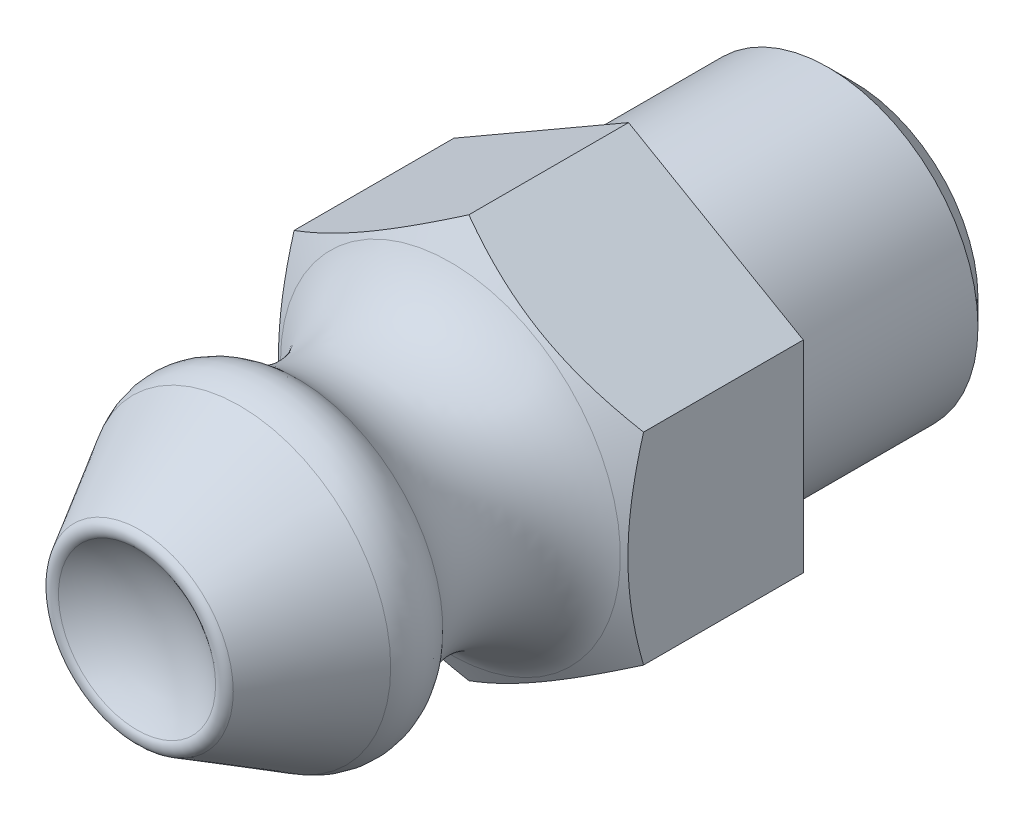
ISO-10303-21;
HEADER;
FILE_DESCRIPTION(('STEP AP214'),'2;1');
FILE_NAME('part.step','',(''),(''),'','','');
FILE_SCHEMA(('AUTOMOTIVE_DESIGN { 1 0 10303 214 1 1 1 1 }'));
ENDSEC;
DATA;
#1=APPLICATION_CONTEXT('core data for automotive mechanical design processes');
#2=APPLICATION_PROTOCOL_DEFINITION('international standard','automotive_design',2000,#1);
#3=PRODUCT_CONTEXT('',#1,'mechanical');
#4=PRODUCT('Part','Part','',(#3));
#5=PRODUCT_RELATED_PRODUCT_CATEGORY('part','',(#4));
#6=PRODUCT_DEFINITION_FORMATION('','',#4);
#7=PRODUCT_DEFINITION_CONTEXT('part definition',#1,'design');
#8=PRODUCT_DEFINITION('design','',#6,#7);
#9=PRODUCT_DEFINITION_SHAPE('','',#8);
#10=(LENGTH_UNIT() NAMED_UNIT(*) SI_UNIT(.MILLI.,.METRE.));
#11=(NAMED_UNIT(*) PLANE_ANGLE_UNIT() SI_UNIT($,.RADIAN.));
#12=(NAMED_UNIT(*) SI_UNIT($,.STERADIAN.) SOLID_ANGLE_UNIT());
#13=UNCERTAINTY_MEASURE_WITH_UNIT(LENGTH_MEASURE(1.E-05),#10,'distance_accuracy_value','');
#14=(GEOMETRIC_REPRESENTATION_CONTEXT(3) GLOBAL_UNCERTAINTY_ASSIGNED_CONTEXT((#13)) GLOBAL_UNIT_ASSIGNED_CONTEXT((#10,
#11,#12)) REPRESENTATION_CONTEXT('',''));
#15=CARTESIAN_POINT('',(0.,0.,0.));
#16=DIRECTION('',(0.,0.,1.));
#17=DIRECTION('',(1.,0.,0.));
#18=AXIS2_PLACEMENT_3D('',#15,#16,#17);
#19=CARTESIAN_POINT('',(3.49999999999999,2.02072594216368,10.));
#20=DIRECTION('',(-0.5,-0.866025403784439,0.));
#21=DIRECTION('',(0.866025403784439,-0.5,0.));
#22=AXIS2_PLACEMENT_3D('',#19,#20,#21);
#23=PLANE('',#22);
#24=DIRECTION('',(0.,0.,-1.));
#25=VECTOR('',#24,1.);
#26=CARTESIAN_POINT('',(0.,4.04145188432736,10.));
#27=LINE('',#26,#25);
#28=CARTESIAN_POINT('',(0.,4.04145188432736,3.2));
#29=VERTEX_POINT('',#28);
#30=CARTESIAN_POINT('',(0.,4.04145188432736,0.));
#31=VERTEX_POINT('',#30);
#32=EDGE_CURVE('E90',#29,#31,#27,.T.);
#33=ORIENTED_EDGE('',*,*,#32,.F.);
#34=CARTESIAN_POINT('',(-0.000200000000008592,4.04156735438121,3.19993333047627));
#35=CARTESIAN_POINT('',(0.153607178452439,3.95276673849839,3.25122160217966));
#36=CARTESIAN_POINT('',(0.308742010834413,3.86319960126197,3.29786643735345));
#37=CARTESIAN_POINT('',(0.621698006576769,3.68251437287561,3.37928551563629));
#38=CARTESIAN_POINT('',(0.779524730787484,3.59139307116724,3.41403095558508));
#39=CARTESIAN_POINT('',(1.09322221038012,3.41027974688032,3.46811736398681));
#40=CARTESIAN_POINT('',(1.24904469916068,3.32031559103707,3.48781830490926));
#41=CARTESIAN_POINT('',(1.56142288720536,3.1399639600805,3.51133725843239));
#42=CARTESIAN_POINT('',(1.71797745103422,3.04957714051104,3.51517474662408));
#43=CARTESIAN_POINT('',(2.01050921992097,2.88068384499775,3.50719208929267));
#44=CARTESIAN_POINT('',(2.14653021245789,2.80215208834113,3.49733195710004));
#45=CARTESIAN_POINT('',(2.41768602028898,2.64560020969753,3.46608092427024));
#46=CARTESIAN_POINT('',(2.55281989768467,2.56758062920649,3.44467934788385));
#47=CARTESIAN_POINT('',(2.82453479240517,2.41070596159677,3.39117698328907));
#48=CARTESIAN_POINT('',(2.96108141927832,2.33187072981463,3.35884939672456));
#49=CARTESIAN_POINT('',(3.23213809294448,2.17537608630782,3.28547845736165));
#50=CARTESIAN_POINT('',(3.36665161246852,2.09771466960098,3.24445234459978));
#51=CARTESIAN_POINT('',(3.50019999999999,2.02061047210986,3.19993333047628));
#52=B_SPLINE_CURVE_WITH_KNOTS('',3,(#34,#35,#36,#37,#38,#39,#40,#41,#42,#43,#44,#45,#46,#47,#48,
#49,#50,#51),.UNSPECIFIED.,.F.,.F.,(4,2,2,2,2,2,2,2,4),(0.,0.554793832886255,1.11092123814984,
1.65328467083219,2.19498204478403,2.6666513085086,3.13875761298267,3.62133612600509,
4.10296698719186),.UNSPECIFIED.);
#53=CARTESIAN_POINT('',(3.49999999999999,2.02072594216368,3.2));
#54=VERTEX_POINT('',#53);
#55=EDGE_CURVE('E83',#29,#54,#52,.T.);
#56=ORIENTED_EDGE('',*,*,#55,.T.);
#57=DIRECTION('',(0.,0.,-1.));
#58=VECTOR('',#57,1.);
#59=CARTESIAN_POINT('',(3.49999999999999,2.02072594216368,10.));
#60=LINE('',#59,#58);
#61=CARTESIAN_POINT('',(3.49999999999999,2.02072594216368,0.));
#62=VERTEX_POINT('',#61);
#63=EDGE_CURVE('E52',#54,#62,#60,.T.);
#64=ORIENTED_EDGE('',*,*,#63,.T.);
#65=DIRECTION('',(-0.866025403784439,0.5,0.));
#66=VECTOR('',#65,1.);
#67=CARTESIAN_POINT('',(3.49999999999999,2.02072594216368,0.));
#68=LINE('',#67,#66);
#69=EDGE_CURVE('E178',#62,#31,#68,.T.);
#70=ORIENTED_EDGE('',*,*,#69,.T.);
#71=EDGE_LOOP('',(#33,#56,#64,#70));
#72=FACE_BOUND('',#71,.T.);
#73=ADVANCED_FACE('F29',(#72),#23,.F.);
#74=CARTESIAN_POINT('',(0.,4.04145188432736,10.));
#75=DIRECTION('',(0.5,-0.866025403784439,0.));
#76=DIRECTION('',(0.866025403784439,0.5,0.));
#77=AXIS2_PLACEMENT_3D('',#74,#75,#76);
#78=PLANE('',#77);
#79=DIRECTION('',(0.,0.,-1.));
#80=VECTOR('',#79,1.);
#81=CARTESIAN_POINT('',(-3.5,2.02072594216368,10.));
#82=LINE('',#81,#80);
#83=CARTESIAN_POINT('',(-3.5,2.02072594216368,3.2));
#84=VERTEX_POINT('',#83);
#85=CARTESIAN_POINT('',(-3.5,2.02072594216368,0.));
#86=VERTEX_POINT('',#85);
#87=EDGE_CURVE('E109',#84,#86,#82,.T.);
#88=ORIENTED_EDGE('',*,*,#87,.F.);
#89=CARTESIAN_POINT('',(-3.5002,2.02061047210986,3.19993333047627));
#90=CARTESIAN_POINT('',(-3.34639282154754,2.10941108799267,3.25122160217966));
#91=CARTESIAN_POINT('',(-3.19125798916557,2.19897822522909,3.29786643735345));
#92=CARTESIAN_POINT('',(-2.87830199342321,2.37966345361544,3.37928551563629));
#93=CARTESIAN_POINT('',(-2.7204752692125,2.47078475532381,3.41403095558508));
#94=CARTESIAN_POINT('',(-2.40677778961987,2.65189807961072,3.46811736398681));
#95=CARTESIAN_POINT('',(-2.2509553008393,2.74186223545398,3.48781830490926));
#96=CARTESIAN_POINT('',(-1.93857711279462,2.92221386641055,3.51133725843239));
#97=CARTESIAN_POINT('',(-1.78202254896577,3.01260068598,3.51517474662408));
#98=CARTESIAN_POINT('',(-1.48949078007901,3.18149398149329,3.50719208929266));
#99=CARTESIAN_POINT('',(-1.35346978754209,3.26002573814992,3.49733195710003));
#100=CARTESIAN_POINT('',(-1.082313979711,3.41657761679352,3.46608092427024));
#101=CARTESIAN_POINT('',(-0.947180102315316,3.49459719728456,3.44467934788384));
#102=CARTESIAN_POINT('',(-0.675465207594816,3.65147186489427,3.39117698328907));
#103=CARTESIAN_POINT('',(-0.538918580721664,3.73030709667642,3.35884939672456));
#104=CARTESIAN_POINT('',(-0.2678619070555,3.88680174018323,3.28547845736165));
#105=CARTESIAN_POINT('',(-0.133348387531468,3.96446315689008,3.24445234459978));
#106=CARTESIAN_POINT('',(0.000199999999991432,4.04156735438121,3.19993333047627));
#107=B_SPLINE_CURVE_WITH_KNOTS('',3,(#89,#90,#91,#92,#93,#94,#95,#96,#97,#98,#99,#100,#101,#102,
#103,#104,#105,#106),.UNSPECIFIED.,.F.,.F.,(4,2,2,2,2,2,2,2,4),(0.,0.554793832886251,
1.11092123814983,1.65328467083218,2.19498204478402,2.66665130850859,3.13875761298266,
3.62133612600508,4.10296698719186),.UNSPECIFIED.);
#108=EDGE_CURVE('E92',#84,#29,#107,.T.);
#109=ORIENTED_EDGE('',*,*,#108,.T.);
#110=ORIENTED_EDGE('',*,*,#32,.T.);
#111=DIRECTION('',(-0.866025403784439,-0.5,0.));
#112=VECTOR('',#111,1.);
#113=CARTESIAN_POINT('',(0.,4.04145188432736,0.));
#114=LINE('',#113,#112);
#115=EDGE_CURVE('E180',#31,#86,#114,.T.);
#116=ORIENTED_EDGE('',*,*,#115,.T.);
#117=EDGE_LOOP('',(#88,#109,#110,#116));
#118=FACE_BOUND('',#117,.T.);
#119=ADVANCED_FACE('F165',(#118),#78,.F.);
#120=CARTESIAN_POINT('',(-3.5,2.02072594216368,10.));
#121=DIRECTION('',(1.,0.,0.));
#122=DIRECTION('',(0.,0.,-1.));
#123=AXIS2_PLACEMENT_3D('',#120,#121,#122);
#124=PLANE('',#123);
#125=DIRECTION('',(0.,0.,-1.));
#126=VECTOR('',#125,1.);
#127=CARTESIAN_POINT('',(-3.5,-2.02072594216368,10.));
#128=LINE('',#127,#126);
#129=CARTESIAN_POINT('',(-3.5,-2.02072594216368,3.2));
#130=VERTEX_POINT('',#129);
#131=CARTESIAN_POINT('',(-3.5,-2.02072594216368,0.));
#132=VERTEX_POINT('',#131);
#133=EDGE_CURVE('E107',#130,#132,#128,.T.);
#134=ORIENTED_EDGE('',*,*,#133,.F.);
#135=CARTESIAN_POINT('',(-3.5,-5.52583422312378,1.75687803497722));
#136=CARTESIAN_POINT('',(-3.5,-5.37211748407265,1.83183287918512));
#137=CARTESIAN_POINT('',(-3.5,-5.21805822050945,1.90609680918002));
#138=CARTESIAN_POINT('',(-3.5,-4.90907285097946,2.0528561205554));
#139=CARTESIAN_POINT('',(-3.5,-4.7541466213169,2.12535124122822));
#140=CARTESIAN_POINT('',(-3.5,-4.44249322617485,2.2685302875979));
#141=CARTESIAN_POINT('',(-3.5,-4.28576089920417,2.33920301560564));
#142=CARTESIAN_POINT('',(-3.5,-3.97108343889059,2.47778423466));
#143=CARTESIAN_POINT('',(-3.5,-3.81313836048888,2.54569285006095));
#144=CARTESIAN_POINT('',(-3.5,-3.49032434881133,2.68029598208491));
#145=CARTESIAN_POINT('',(-3.5,-3.32540419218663,2.74686829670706));
#146=CARTESIAN_POINT('',(-3.5,-2.99367085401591,2.87520749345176));
#147=CARTESIAN_POINT('',(-3.5,-2.82685746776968,2.93697385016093));
#148=CARTESIAN_POINT('',(-3.5,-2.49135415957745,3.05415097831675));
#149=CARTESIAN_POINT('',(-3.5,-2.32266849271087,3.10957381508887));
#150=CARTESIAN_POINT('',(-3.5,-1.98287908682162,3.21235049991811));
#151=CARTESIAN_POINT('',(-3.5,-1.8117760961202,3.25970678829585));
#152=CARTESIAN_POINT('',(-3.5,-1.46802454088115,3.34388578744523));
#153=CARTESIAN_POINT('',(-3.5,-1.29539108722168,3.3807690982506));
#154=CARTESIAN_POINT('',(-3.5,-0.947878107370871,3.44198990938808));
#155=CARTESIAN_POINT('',(-3.5,-0.772998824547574,3.46632875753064));
#156=CARTESIAN_POINT('',(-3.5,-0.424190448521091,3.50020557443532));
#157=CARTESIAN_POINT('',(-3.5,-0.250281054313,3.50994135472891));
#158=CARTESIAN_POINT('',(-3.5,0.0977454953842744,3.51431402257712));
#159=CARTESIAN_POINT('',(-3.5,0.271862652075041,3.50895082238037));
#160=CARTESIAN_POINT('',(-3.5,0.564627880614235,3.48762671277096));
#161=CARTESIAN_POINT('',(-3.5,0.68357530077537,3.47550945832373));
#162=CARTESIAN_POINT('',(-3.5,0.920657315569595,3.44493152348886));
#163=CARTESIAN_POINT('',(-3.5,1.03879180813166,3.42647006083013));
#164=CARTESIAN_POINT('',(-3.5,1.39178600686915,3.36253364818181));
#165=CARTESIAN_POINT('',(-3.5,1.62511891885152,3.30851642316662));
#166=CARTESIAN_POINT('',(-3.5,1.97416266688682,3.21410884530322));
#167=CARTESIAN_POINT('',(-3.5,2.09166214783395,3.17994810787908));
#168=CARTESIAN_POINT('',(-3.5,2.32552183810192,3.10789323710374));
#169=CARTESIAN_POINT('',(-3.5,2.44188203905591,3.06999907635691));
#170=CARTESIAN_POINT('',(-3.5,2.67349675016,2.99110068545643));
#171=CARTESIAN_POINT('',(-3.5,2.7887515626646,2.95009733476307));
#172=CARTESIAN_POINT('',(-3.5,3.01829378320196,2.86548132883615));
#173=CARTESIAN_POINT('',(-3.5,3.13258120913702,2.82186872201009));
#174=CARTESIAN_POINT('',(-3.5,3.42529410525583,2.70694549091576));
#175=CARTESIAN_POINT('',(-3.5,3.60309075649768,2.63403521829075));
#176=CARTESIAN_POINT('',(-3.5,3.95695607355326,2.48412160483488));
#177=CARTESIAN_POINT('',(-3.5,4.13302457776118,2.40711788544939));
#178=CARTESIAN_POINT('',(-3.5,4.48379535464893,2.24993137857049));
#179=CARTESIAN_POINT('',(-3.5,4.65849720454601,2.16974765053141));
#180=CARTESIAN_POINT('',(-3.5,5.00674520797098,2.00690423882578));
#181=CARTESIAN_POINT('',(-3.5,5.18029132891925,1.92424448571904));
#182=CARTESIAN_POINT('',(-3.5,5.70000714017,1.67311548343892));
#183=CARTESIAN_POINT('',(-3.5,6.04476179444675,1.50172095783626));
#184=CARTESIAN_POINT('',(-3.5,6.7316346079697,1.15391515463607));
#185=CARTESIAN_POINT('',(-3.5,7.07375322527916,0.977504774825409));
#186=CARTESIAN_POINT('',(-3.5,7.72286278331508,0.638595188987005));
#187=CARTESIAN_POINT('',(-3.5,8.03002270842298,0.476419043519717));
#188=CARTESIAN_POINT('',(-3.5,8.64324723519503,0.149974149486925));
#189=CARTESIAN_POINT('',(-3.5,8.94931177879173,-0.0142947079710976));
#190=CARTESIAN_POINT('',(-3.5,9.55963820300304,-0.343883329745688));
#191=CARTESIAN_POINT('',(-3.5,9.8639027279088,-0.509198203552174));
#192=CARTESIAN_POINT('',(-3.5,10.4717429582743,-0.841038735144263));
#193=CARTESIAN_POINT('',(-3.5,10.775318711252,-1.00756430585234));
#194=CARTESIAN_POINT('',(-3.5,11.0786482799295,-1.17453388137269));
#195=B_SPLINE_CURVE_WITH_KNOTS('',3,(#135,#136,#137,#138,#139,#140,#141,#142,#143,#144,#145,
#146,#147,#148,#149,#150,#151,#152,#153,#154,#155,#156,#157,#158,#159,#160,#161,#162,#163,#164,
#165,#166,#167,#168,#169,#170,#171,#172,#173,#174,#175,#176,#177,#178,#179,#180,#181,#182,#183,
#184,#185,#186,#187,#188,#189,#190,#191,#192,#193,#194),.UNSPECIFIED.,.F.,.F.,(4,2,2,2,2,2,2,2,
2,2,2,2,2,2,2,2,2,2,2,2,2,2,2,2,2,2,2,2,2,4),(0.,0.513059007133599,1.02619318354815,
1.54195941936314,2.05770242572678,2.59119370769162,3.12474323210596,3.65726046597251,
4.18961631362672,4.71882590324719,5.24797862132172,5.76989663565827,6.29181768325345,
6.65033463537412,7.00889581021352,7.72637029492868,8.09343015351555,8.46049270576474,
8.8274518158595,9.19440412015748,9.77082677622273,10.3473028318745,10.9239506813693,
11.5006147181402,12.6555660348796,13.8103119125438,14.8523350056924,15.8944125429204,
16.9332324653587,17.9719783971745),.UNSPECIFIED.);
#196=EDGE_CURVE('E152',#130,#84,#195,.T.);
#197=ORIENTED_EDGE('',*,*,#196,.T.);
#198=ORIENTED_EDGE('',*,*,#87,.T.);
#199=DIRECTION('',(0.,-1.,0.));
#200=VECTOR('',#199,1.);
#201=CARTESIAN_POINT('',(-3.5,2.02072594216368,0.));
#202=LINE('',#201,#200);
#203=EDGE_CURVE('E183',#86,#132,#202,.T.);
#204=ORIENTED_EDGE('',*,*,#203,.T.);
#205=EDGE_LOOP('',(#134,#197,#198,#204));
#206=FACE_BOUND('',#205,.T.);
#207=ADVANCED_FACE('F162',(#206),#124,.F.);
#208=CARTESIAN_POINT('',(-3.5,-2.02072594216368,10.));
#209=DIRECTION('',(0.500000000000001,0.866025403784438,0.));
#210=DIRECTION('',(-0.866025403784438,0.500000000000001,0.));
#211=AXIS2_PLACEMENT_3D('',#208,#209,#210);
#212=PLANE('',#211);
#213=DIRECTION('',(0.,0.,-1.));
#214=VECTOR('',#213,1.);
#215=CARTESIAN_POINT('',(0.,-4.04145188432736,10.));
#216=LINE('',#215,#214);
#217=CARTESIAN_POINT('',(0.,-4.04145188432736,3.2));
#218=VERTEX_POINT('',#217);
#219=CARTESIAN_POINT('',(0.,-4.04145188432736,0.));
#220=VERTEX_POINT('',#219);
#221=EDGE_CURVE('E100',#218,#220,#216,.T.);
#222=ORIENTED_EDGE('',*,*,#221,.F.);
#223=CARTESIAN_POINT('',(0.000199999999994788,-4.04156735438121,3.19993333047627));
#224=CARTESIAN_POINT('',(-0.153607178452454,-3.95276673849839,3.25122160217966));
#225=CARTESIAN_POINT('',(-0.308742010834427,-3.86319960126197,3.29786643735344));
#226=CARTESIAN_POINT('',(-0.621698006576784,-3.68251437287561,3.37928551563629));
#227=CARTESIAN_POINT('',(-0.779524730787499,-3.59139307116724,3.41403095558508));
#228=CARTESIAN_POINT('',(-1.09322221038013,-3.41027974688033,3.46811736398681));
#229=CARTESIAN_POINT('',(-1.2490446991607,-3.32031559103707,3.48781830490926));
#230=CARTESIAN_POINT('',(-1.56142288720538,-3.1399639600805,3.51133725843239));
#231=CARTESIAN_POINT('',(-1.71797745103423,-3.04957714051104,3.51517474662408));
#232=CARTESIAN_POINT('',(-2.01050921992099,-2.88068384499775,3.50719208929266));
#233=CARTESIAN_POINT('',(-2.14653021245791,-2.80215208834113,3.49733195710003));
#234=CARTESIAN_POINT('',(-2.417686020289,-2.64560020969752,3.46608092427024));
#235=CARTESIAN_POINT('',(-2.55281989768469,-2.56758062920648,3.44467934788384));
#236=CARTESIAN_POINT('',(-2.82453479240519,-2.41070596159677,3.39117698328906));
#237=CARTESIAN_POINT('',(-2.96108141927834,-2.33187072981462,3.35884939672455));
#238=CARTESIAN_POINT('',(-3.2321380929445,-2.17537608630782,3.28547845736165));
#239=CARTESIAN_POINT('',(-3.36665161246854,-2.09771466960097,3.24445234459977));
#240=CARTESIAN_POINT('',(-3.5002,-2.02061047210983,3.19993333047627));
#241=B_SPLINE_CURVE_WITH_KNOTS('',3,(#223,#224,#225,#226,#227,#228,#229,#230,#231,#232,#233,
#234,#235,#236,#237,#238,#239,#240),.UNSPECIFIED.,.F.,.F.,(4,2,2,2,2,2,2,2,4),(0.,
0.554793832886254,1.11092123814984,1.65328467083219,2.19498204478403,2.6666513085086,
3.13875761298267,3.6213361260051,4.10296698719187),.UNSPECIFIED.);
#242=EDGE_CURVE('E144',#218,#130,#241,.T.);
#243=ORIENTED_EDGE('',*,*,#242,.T.);
#244=ORIENTED_EDGE('',*,*,#133,.T.);
#245=DIRECTION('',(0.866025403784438,-0.500000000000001,0.));
#246=VECTOR('',#245,1.);
#247=CARTESIAN_POINT('',(-3.5,-2.02072594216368,0.));
#248=LINE('',#247,#246);
#249=EDGE_CURVE('E186',#132,#220,#248,.T.);
#250=ORIENTED_EDGE('',*,*,#249,.T.);
#251=EDGE_LOOP('',(#222,#243,#244,#250));
#252=FACE_BOUND('',#251,.T.);
#253=ADVANCED_FACE('F134',(#252),#212,.F.);
#254=CARTESIAN_POINT('',(0.,-4.04145188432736,10.));
#255=DIRECTION('',(-0.500000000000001,0.866025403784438,0.));
#256=DIRECTION('',(-0.866025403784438,-0.500000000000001,0.));
#257=AXIS2_PLACEMENT_3D('',#254,#255,#256);
#258=PLANE('',#257);
#259=DIRECTION('',(0.,0.,-1.));
#260=VECTOR('',#259,1.);
#261=CARTESIAN_POINT('',(3.49999999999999,-2.02072594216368,10.));
#262=LINE('',#261,#260);
#263=CARTESIAN_POINT('',(3.49999999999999,-2.02072594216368,3.20000000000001));
#264=VERTEX_POINT('',#263);
#265=CARTESIAN_POINT('',(3.49999999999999,-2.02072594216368,0.));
#266=VERTEX_POINT('',#265);
#267=EDGE_CURVE('E98',#264,#266,#262,.T.);
#268=ORIENTED_EDGE('',*,*,#267,.F.);
#269=CARTESIAN_POINT('',(3.50019999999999,-2.02061047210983,3.19993333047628));
#270=CARTESIAN_POINT('',(3.34639282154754,-2.10941108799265,3.25122160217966));
#271=CARTESIAN_POINT('',(3.19125798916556,-2.19897822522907,3.29786643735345));
#272=CARTESIAN_POINT('',(2.87830199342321,-2.37966345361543,3.3792855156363));
#273=CARTESIAN_POINT('',(2.72047526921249,-2.47078475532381,3.41403095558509));
#274=CARTESIAN_POINT('',(2.40677778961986,-2.65189807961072,3.46811736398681));
#275=CARTESIAN_POINT('',(2.2509553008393,-2.74186223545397,3.48781830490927));
#276=CARTESIAN_POINT('',(1.93857711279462,-2.92221386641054,3.51133725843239));
#277=CARTESIAN_POINT('',(1.78202254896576,-3.01260068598,3.51517474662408));
#278=CARTESIAN_POINT('',(1.48949078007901,-3.18149398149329,3.50719208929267));
#279=CARTESIAN_POINT('',(1.35346978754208,-3.26002573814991,3.49733195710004));
#280=CARTESIAN_POINT('',(1.08231397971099,-3.41657761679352,3.46608092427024));
#281=CARTESIAN_POINT('',(0.947180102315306,-3.49459719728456,3.44467934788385));
#282=CARTESIAN_POINT('',(0.675465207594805,-3.65147186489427,3.39117698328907));
#283=CARTESIAN_POINT('',(0.538918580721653,-3.73030709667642,3.35884939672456));
#284=CARTESIAN_POINT('',(0.267861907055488,-3.88680174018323,3.28547845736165));
#285=CARTESIAN_POINT('',(0.133348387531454,-3.96446315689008,3.24445234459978));
#286=CARTESIAN_POINT('',(-0.000200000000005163,-4.04156735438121,3.19993333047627));
#287=B_SPLINE_CURVE_WITH_KNOTS('',3,(#269,#270,#271,#272,#273,#274,#275,#276,#277,#278,#279,
#280,#281,#282,#283,#284,#285,#286),.UNSPECIFIED.,.F.,.F.,(4,2,2,2,2,2,2,2,4),(0.,
0.554793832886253,1.11092123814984,1.65328467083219,2.19498204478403,2.6666513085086,
3.13875761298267,3.6213361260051,4.10296698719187),.UNSPECIFIED.);
#288=EDGE_CURVE('E44',#264,#218,#287,.T.);
#289=ORIENTED_EDGE('',*,*,#288,.T.);
#290=ORIENTED_EDGE('',*,*,#221,.T.);
#291=DIRECTION('',(0.866025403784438,0.500000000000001,0.));
#292=VECTOR('',#291,1.);
#293=CARTESIAN_POINT('',(0.,-4.04145188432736,0.));
#294=LINE('',#293,#292);
#295=EDGE_CURVE('E102',#220,#266,#294,.T.);
#296=ORIENTED_EDGE('',*,*,#295,.T.);
#297=EDGE_LOOP('',(#268,#289,#290,#296));
#298=FACE_BOUND('',#297,.T.);
#299=ADVANCED_FACE('F129',(#298),#258,.F.);
#300=CARTESIAN_POINT('',(3.49999999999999,-2.02072594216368,10.));
#301=DIRECTION('',(-1.,0.,0.));
#302=DIRECTION('',(0.,0.,1.));
#303=AXIS2_PLACEMENT_3D('',#300,#301,#302);
#304=PLANE('',#303);
#305=ORIENTED_EDGE('',*,*,#63,.F.);
#306=CARTESIAN_POINT('',(3.49999999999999,-5.52583422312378,1.75687803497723));
#307=CARTESIAN_POINT('',(3.49999999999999,-5.37211748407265,1.83183287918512));
#308=CARTESIAN_POINT('',(3.49999999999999,-5.21805822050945,1.90609680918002));
#309=CARTESIAN_POINT('',(3.49999999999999,-4.90907285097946,2.0528561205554));
#310=CARTESIAN_POINT('',(3.49999999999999,-4.75414662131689,2.12535124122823));
#311=CARTESIAN_POINT('',(3.49999999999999,-4.44249322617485,2.2685302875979));
#312=CARTESIAN_POINT('',(3.49999999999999,-4.28576089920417,2.33920301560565));
#313=CARTESIAN_POINT('',(3.49999999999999,-3.97108343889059,2.47778423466));
#314=CARTESIAN_POINT('',(3.49999999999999,-3.81313836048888,2.54569285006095));
#315=CARTESIAN_POINT('',(3.49999999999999,-3.49032434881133,2.68029598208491));
#316=CARTESIAN_POINT('',(3.49999999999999,-3.32540419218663,2.74686829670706));
#317=CARTESIAN_POINT('',(3.49999999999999,-2.99367085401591,2.87520749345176));
#318=CARTESIAN_POINT('',(3.49999999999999,-2.82685746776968,2.93697385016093));
#319=CARTESIAN_POINT('',(3.49999999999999,-2.49135415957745,3.05415097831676));
#320=CARTESIAN_POINT('',(3.49999999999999,-2.32266849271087,3.10957381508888));
#321=CARTESIAN_POINT('',(3.49999999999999,-1.98287908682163,3.21235049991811));
#322=CARTESIAN_POINT('',(3.49999999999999,-1.8117760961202,3.25970678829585));
#323=CARTESIAN_POINT('',(3.49999999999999,-1.46802454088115,3.34388578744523));
#324=CARTESIAN_POINT('',(3.49999999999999,-1.29539108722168,3.3807690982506));
#325=CARTESIAN_POINT('',(3.49999999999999,-0.947878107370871,3.44198990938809));
#326=CARTESIAN_POINT('',(3.49999999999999,-0.772998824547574,3.46632875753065));
#327=CARTESIAN_POINT('',(3.49999999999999,-0.424190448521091,3.50020557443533));
#328=CARTESIAN_POINT('',(3.49999999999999,-0.250281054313,3.50994135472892));
#329=CARTESIAN_POINT('',(3.49999999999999,0.0977454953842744,3.51431402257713));
#330=CARTESIAN_POINT('',(3.49999999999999,0.271862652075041,3.50895082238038));
#331=CARTESIAN_POINT('',(3.49999999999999,0.564627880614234,3.48762671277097));
#332=CARTESIAN_POINT('',(3.49999999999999,0.683575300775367,3.47550945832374));
#333=CARTESIAN_POINT('',(3.49999999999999,0.92065731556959,3.44493152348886));
#334=CARTESIAN_POINT('',(3.49999999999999,1.03879180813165,3.42647006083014));
#335=CARTESIAN_POINT('',(3.49999999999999,1.39178600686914,3.36253364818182));
#336=CARTESIAN_POINT('',(3.49999999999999,1.62511891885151,3.30851642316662));
#337=CARTESIAN_POINT('',(3.49999999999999,1.9741626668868,3.21410884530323));
#338=CARTESIAN_POINT('',(3.49999999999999,2.09166214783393,3.17994810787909));
#339=CARTESIAN_POINT('',(3.49999999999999,2.3255218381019,3.10789323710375));
#340=CARTESIAN_POINT('',(3.49999999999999,2.44188203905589,3.06999907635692));
#341=CARTESIAN_POINT('',(3.49999999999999,2.67349675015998,2.99110068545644));
#342=CARTESIAN_POINT('',(3.49999999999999,2.78875156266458,2.95009733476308));
#343=CARTESIAN_POINT('',(3.49999999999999,3.01829378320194,2.86548132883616));
#344=CARTESIAN_POINT('',(3.49999999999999,3.13258120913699,2.8218687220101));
#345=CARTESIAN_POINT('',(3.49999999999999,3.42529410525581,2.70694549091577));
#346=CARTESIAN_POINT('',(3.49999999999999,3.60309075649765,2.63403521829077));
#347=CARTESIAN_POINT('',(3.49999999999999,3.95695607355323,2.4841216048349));
#348=CARTESIAN_POINT('',(3.49999999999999,4.13302457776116,2.4071178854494));
#349=CARTESIAN_POINT('',(3.49999999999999,4.48379535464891,2.2499313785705));
#350=CARTESIAN_POINT('',(3.49999999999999,4.65849720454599,2.16974765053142));
#351=CARTESIAN_POINT('',(3.49999999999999,5.00674520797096,2.0069042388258));
#352=CARTESIAN_POINT('',(3.49999999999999,5.18029132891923,1.92424448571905));
#353=CARTESIAN_POINT('',(3.49999999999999,5.70000714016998,1.67311548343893));
#354=CARTESIAN_POINT('',(3.49999999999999,6.04476179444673,1.50172095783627));
#355=CARTESIAN_POINT('',(3.49999999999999,6.73163460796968,1.15391515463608));
#356=CARTESIAN_POINT('',(3.49999999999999,7.07375322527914,0.977504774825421));
#357=CARTESIAN_POINT('',(3.49999999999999,7.72286278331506,0.638595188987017));
#358=CARTESIAN_POINT('',(3.49999999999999,8.03002270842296,0.476419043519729));
#359=CARTESIAN_POINT('',(3.49999999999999,8.64324723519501,0.149974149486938));
#360=CARTESIAN_POINT('',(3.49999999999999,8.94931177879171,-0.0142947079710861));
#361=CARTESIAN_POINT('',(3.49999999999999,9.55963820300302,-0.343883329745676));
#362=CARTESIAN_POINT('',(3.49999999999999,9.86390272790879,-0.509198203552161));
#363=CARTESIAN_POINT('',(3.49999999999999,10.4717429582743,-0.841038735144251));
#364=CARTESIAN_POINT('',(3.49999999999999,10.775318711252,-1.00756430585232));
#365=CARTESIAN_POINT('',(3.49999999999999,11.0786482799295,-1.17453388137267));
#366=B_SPLINE_CURVE_WITH_KNOTS('',3,(#306,#307,#308,#309,#310,#311,#312,#313,#314,#315,#316,
#317,#318,#319,#320,#321,#322,#323,#324,#325,#326,#327,#328,#329,#330,#331,#332,#333,#334,#335,
#336,#337,#338,#339,#340,#341,#342,#343,#344,#345,#346,#347,#348,#349,#350,#351,#352,#353,#354,
#355,#356,#357,#358,#359,#360,#361,#362,#363,#364,#365),.UNSPECIFIED.,.F.,.F.,(4,2,2,2,2,2,2,2,
2,2,2,2,2,2,2,2,2,2,2,2,2,2,2,2,2,2,2,2,2,4),(0.,0.5130590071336,1.02619318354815,
1.54195941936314,2.05770242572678,2.59119370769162,3.12474323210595,3.65726046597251,
4.18961631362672,4.71882590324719,5.24797862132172,5.76989663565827,6.29181768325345,
6.65033463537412,7.00889581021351,7.72637029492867,8.09343015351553,8.46049270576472,
8.82745181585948,9.19440412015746,9.7708267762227,10.3473028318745,10.9239506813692,
11.5006147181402,12.6555660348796,13.8103119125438,14.8523350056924,15.8944125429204,
16.9332324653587,17.9719783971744),.UNSPECIFIED.);
#367=EDGE_CURVE('E81',#54,#264,#366,.F.);
#368=ORIENTED_EDGE('',*,*,#367,.T.);
#369=ORIENTED_EDGE('',*,*,#267,.T.);
#370=DIRECTION('',(0.,1.,0.));
#371=VECTOR('',#370,1.);
#372=CARTESIAN_POINT('',(3.49999999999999,-2.02072594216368,0.));
#373=LINE('',#372,#371);
#374=EDGE_CURVE('E96',#266,#62,#373,.T.);
#375=ORIENTED_EDGE('',*,*,#374,.T.);
#376=EDGE_LOOP('',(#305,#368,#369,#375));
#377=FACE_BOUND('',#376,.T.);
#378=ADVANCED_FACE('F94',(#377),#304,.F.);
#379=CARTESIAN_POINT('',(-3.5,6.06217782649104,0.));
#380=DIRECTION('',(0.,0.,1.));
#381=DIRECTION('',(1.,0.,0.));
#382=AXIS2_PLACEMENT_3D('',#379,#380,#381);
#383=PLANE('',#382);
#384=CARTESIAN_POINT('',(0.,0.,0.));
#385=DIRECTION('',(0.,0.,1.));
#386=DIRECTION('',(1.,0.,0.));
#387=AXIS2_PLACEMENT_3D('',#384,#385,#386);
#388=CIRCLE('',#387,3.);
#389=CARTESIAN_POINT('',(3.,0.,0.));
#390=VERTEX_POINT('',#389);
#391=EDGE_CURVE('E91',#390,#390,#388,.T.);
#392=ORIENTED_EDGE('',*,*,#391,.T.);
#393=EDGE_LOOP('',(#392));
#394=FACE_BOUND('',#393,.T.);
#395=ORIENTED_EDGE('',*,*,#69,.F.);
#396=ORIENTED_EDGE('',*,*,#374,.F.);
#397=ORIENTED_EDGE('',*,*,#295,.F.);
#398=ORIENTED_EDGE('',*,*,#249,.F.);
#399=ORIENTED_EDGE('',*,*,#203,.F.);
#400=ORIENTED_EDGE('',*,*,#115,.F.);
#401=EDGE_LOOP('',(#395,#396,#397,#398,#399,#400));
#402=FACE_BOUND('',#401,.T.);
#403=ADVANCED_FACE('F128',(#394,#402),#383,.F.);
#404=CARTESIAN_POINT('',(0.,0.,-4.5));
#405=DIRECTION('',(0.,0.,1.));
#406=DIRECTION('',(1.,0.,0.));
#407=AXIS2_PLACEMENT_3D('',#404,#405,#406);
#408=CYLINDRICAL_SURFACE('',#407,3.);
#409=CARTESIAN_POINT('',(0.,0.,-4.));
#410=DIRECTION('',(0.,0.,1.));
#411=DIRECTION('',(1.,0.,0.));
#412=AXIS2_PLACEMENT_3D('',#409,#410,#411);
#413=CIRCLE('',#412,3.);
#414=CARTESIAN_POINT('',(3.,0.,-4.));
#415=VERTEX_POINT('',#414);
#416=EDGE_CURVE('E112',#415,#415,#413,.T.);
#417=ORIENTED_EDGE('',*,*,#416,.T.);
#418=EDGE_LOOP('',(#417));
#419=FACE_BOUND('',#418,.T.);
#420=ORIENTED_EDGE('',*,*,#391,.F.);
#421=EDGE_LOOP('',(#420));
#422=FACE_BOUND('',#421,.T.);
#423=ADVANCED_FACE('F217',(#419,#422),#408,.T.);
#424=CARTESIAN_POINT('',(0.,0.,-4.5));
#425=DIRECTION('',(0.,0.,1.));
#426=DIRECTION('',(1.,0.,0.));
#427=AXIS2_PLACEMENT_3D('',#424,#425,#426);
#428=PLANE('',#427);
#429=CARTESIAN_POINT('',(0.,0.,-4.5));
#430=DIRECTION('',(0.,0.,1.));
#431=DIRECTION('',(1.,0.,0.));
#432=AXIS2_PLACEMENT_3D('',#429,#430,#431);
#433=CIRCLE('',#432,2.5);
#434=CARTESIAN_POINT('',(2.5,0.,-4.5));
#435=VERTEX_POINT('',#434);
#436=EDGE_CURVE('E87',#435,#435,#433,.F.);
#437=ORIENTED_EDGE('',*,*,#436,.T.);
#438=EDGE_LOOP('',(#437));
#439=FACE_BOUND('',#438,.T.);
#440=ADVANCED_FACE('F224',(#439),#428,.F.);
#441=CARTESIAN_POINT('',(0.,0.,-4.));
#442=DIRECTION('',(0.,0.,1.));
#443=DIRECTION('',(1.,0.,0.));
#444=AXIS2_PLACEMENT_3D('',#441,#442,#443);
#445=CONICAL_SURFACE('',#444,3.,0.78539816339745);
#446=ORIENTED_EDGE('',*,*,#436,.F.);
#447=EDGE_LOOP('',(#446));
#448=FACE_BOUND('',#447,.T.);
#449=ORIENTED_EDGE('',*,*,#416,.F.);
#450=EDGE_LOOP('',(#449));
#451=FACE_BOUND('',#450,.T.);
#452=ADVANCED_FACE('F231',(#448,#451),#445,.T.);
#453=CARTESIAN_POINT('',(0.,0.,3.56794919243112));
#454=DIRECTION('',(0.,0.,-1.));
#455=DIRECTION('',(-1.,0.,0.));
#456=AXIS2_PLACEMENT_3D('',#453,#454,#455);
#457=CONICAL_SURFACE('',#456,3.40414518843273,1.0471975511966);
#458=CARTESIAN_POINT('',(0.,0.,3.56794919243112));
#459=DIRECTION('',(0.,0.,-1.));
#460=DIRECTION('',(-1.,0.,0.));
#461=AXIS2_PLACEMENT_3D('',#458,#459,#460);
#462=CIRCLE('',#461,3.40414518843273);
#463=CARTESIAN_POINT('',(-3.40414518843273,0.,3.56794919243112));
#464=VERTEX_POINT('',#463);
#465=EDGE_CURVE('E145',#464,#464,#462,.T.);
#466=ORIENTED_EDGE('',*,*,#465,.T.);
#467=EDGE_LOOP('',(#466));
#468=FACE_BOUND('',#467,.T.);
#469=ORIENTED_EDGE('',*,*,#108,.F.);
#470=ORIENTED_EDGE('',*,*,#196,.F.);
#471=ORIENTED_EDGE('',*,*,#242,.F.);
#472=ORIENTED_EDGE('',*,*,#288,.F.);
#473=ORIENTED_EDGE('',*,*,#367,.F.);
#474=ORIENTED_EDGE('',*,*,#55,.F.);
#475=EDGE_LOOP('',(#469,#470,#471,#472,#473,#474));
#476=FACE_BOUND('',#475,.T.);
#477=ADVANCED_FACE('F82',(#468,#476),#457,.T.);
#478=CARTESIAN_POINT('',(0.,0.,5.3));
#479=DIRECTION('',(0.,0.,-1.));
#480=DIRECTION('',(-1.,0.,0.));
#481=AXIS2_PLACEMENT_3D('',#478,#479,#480);
#482=TOROIDAL_SURFACE('',#481,4.40414518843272,2.);
#483=ORIENTED_EDGE('',*,*,#465,.F.);
#484=EDGE_LOOP('',(#483));
#485=FACE_BOUND('',#484,.T.);
#486=CARTESIAN_POINT('',(0.,0.,6.62700622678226));
#487=DIRECTION('',(0.,0.,-1.));
#488=DIRECTION('',(-1.,0.,0.));
#489=AXIS2_PLACEMENT_3D('',#486,#487,#488);
#490=CIRCLE('',#489,2.90779814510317);
#491=CARTESIAN_POINT('',(-2.90779814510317,0.,6.62700622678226));
#492=VERTEX_POINT('',#491);
#493=EDGE_CURVE('E335',#492,#492,#490,.T.);
#494=ORIENTED_EDGE('',*,*,#493,.T.);
#495=EDGE_LOOP('',(#494));
#496=FACE_BOUND('',#495,.T.);
#497=ADVANCED_FACE('F246',(#485,#496),#482,.F.);
#498=CARTESIAN_POINT('',(0.,0.,10.));
#499=DIRECTION('',(0.,0.,-1.));
#500=DIRECTION('',(-1.,0.,0.));
#501=AXIS2_PLACEMENT_3D('',#498,#499,#500);
#502=CONICAL_SURFACE('',#501,1.75,0.523598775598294);
#503=CARTESIAN_POINT('',(0.,0.,9.79018938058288));
#504=DIRECTION('',(0.,0.,-1.));
#505=DIRECTION('',(-1.,0.,0.));
#506=AXIS2_PLACEMENT_3D('',#503,#504,#505);
#507=CIRCLE('',#506,1.87113421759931);
#508=CARTESIAN_POINT('',(-1.87113421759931,0.,9.79018938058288));
#509=VERTEX_POINT('',#508);
#510=EDGE_CURVE('E37',#509,#509,#507,.T.);
#511=ORIENTED_EDGE('',*,*,#510,.T.);
#512=EDGE_LOOP('',(#511));
#513=FACE_BOUND('',#512,.T.);
#514=CARTESIAN_POINT('',(0.,0.,7.7905093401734));
#515=DIRECTION('',(0.,0.,-1.));
#516=DIRECTION('',(-1.,0.,0.));
#517=AXIS2_PLACEMENT_3D('',#514,#515,#516);
#518=CIRCLE('',#517,3.02565002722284);
#519=CARTESIAN_POINT('',(-3.02565002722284,0.,7.7905093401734));
#520=VERTEX_POINT('',#519);
#521=EDGE_CURVE('E333',#520,#520,#518,.T.);
#522=ORIENTED_EDGE('',*,*,#521,.F.);
#523=EDGE_LOOP('',(#522));
#524=FACE_BOUND('',#523,.T.);
#525=ADVANCED_FACE('F253',(#513,#524),#502,.T.);
#526=CARTESIAN_POINT('',(0.,0.,7.2905093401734));
#527=DIRECTION('',(0.,0.,-1.));
#528=DIRECTION('',(-1.,0.,0.));
#529=AXIS2_PLACEMENT_3D('',#526,#527,#528);
#530=TOROIDAL_SURFACE('',#529,2.1596246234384,1.);
#531=ORIENTED_EDGE('',*,*,#493,.F.);
#532=EDGE_LOOP('',(#531));
#533=FACE_BOUND('',#532,.T.);
#534=ORIENTED_EDGE('',*,*,#521,.T.);
#535=EDGE_LOOP('',(#534));
#536=FACE_BOUND('',#535,.T.);
#537=ADVANCED_FACE('F260',(#533,#536),#530,.T.);
#538=CARTESIAN_POINT('',(0.,0.,11.8375));
#539=DIRECTION('',(0.,0.,1.));
#540=DIRECTION('',(1.,0.,0.));
#541=AXIS2_PLACEMENT_3D('',#538,#539,#540);
#542=SPHERICAL_SURFACE('',#541,2.5375);
#543=CARTESIAN_POINT('',(0.,0.,9.84707052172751));
#544=DIRECTION('',(0.,0.,1.));
#545=DIRECTION('',(1.,0.,0.));
#546=AXIS2_PLACEMENT_3D('',#543,#544,#545);
#547=CIRCLE('',#546,1.57387951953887);
#548=CARTESIAN_POINT('',(1.57387951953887,0.,9.84707052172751));
#549=VERTEX_POINT('',#548);
#550=EDGE_CURVE('E11',#549,#549,#547,.T.);
#551=ORIENTED_EDGE('',*,*,#550,.T.);
#552=EDGE_LOOP('',(#551));
#553=FACE_BOUND('',#552,.T.);
#554=ADVANCED_FACE('F31',(#553),#542,.F.);
#555=CARTESIAN_POINT('',(0.,0.,9.69018938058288));
#556=DIRECTION('',(0.,0.,1.));
#557=DIRECTION('',(1.,0.,0.));
#558=AXIS2_PLACEMENT_3D('',#555,#556,#557);
#559=TOROIDAL_SURFACE('',#558,1.69792913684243,0.2);
#560=ORIENTED_EDGE('',*,*,#550,.F.);
#561=EDGE_LOOP('',(#560));
#562=FACE_BOUND('',#561,.T.);
#563=ORIENTED_EDGE('',*,*,#510,.F.);
#564=EDGE_LOOP('',(#563));
#565=FACE_BOUND('',#564,.T.);
#566=ADVANCED_FACE('F274',(#562,#565),#559,.T.);
#567=CLOSED_SHELL('',(#73,#119,#207,#253,#299,#378,#403,#423,#440,#452,#477,#497,#525,#537,#554,#566));
#568=MANIFOLD_SOLID_BREP('B2',#567);
#569=ADVANCED_BREP_SHAPE_REPRESENTATION('',(#18,#568),#14);
#570=SHAPE_DEFINITION_REPRESENTATION(#9,#569);
ENDSEC;
END-ISO-10303-21;
